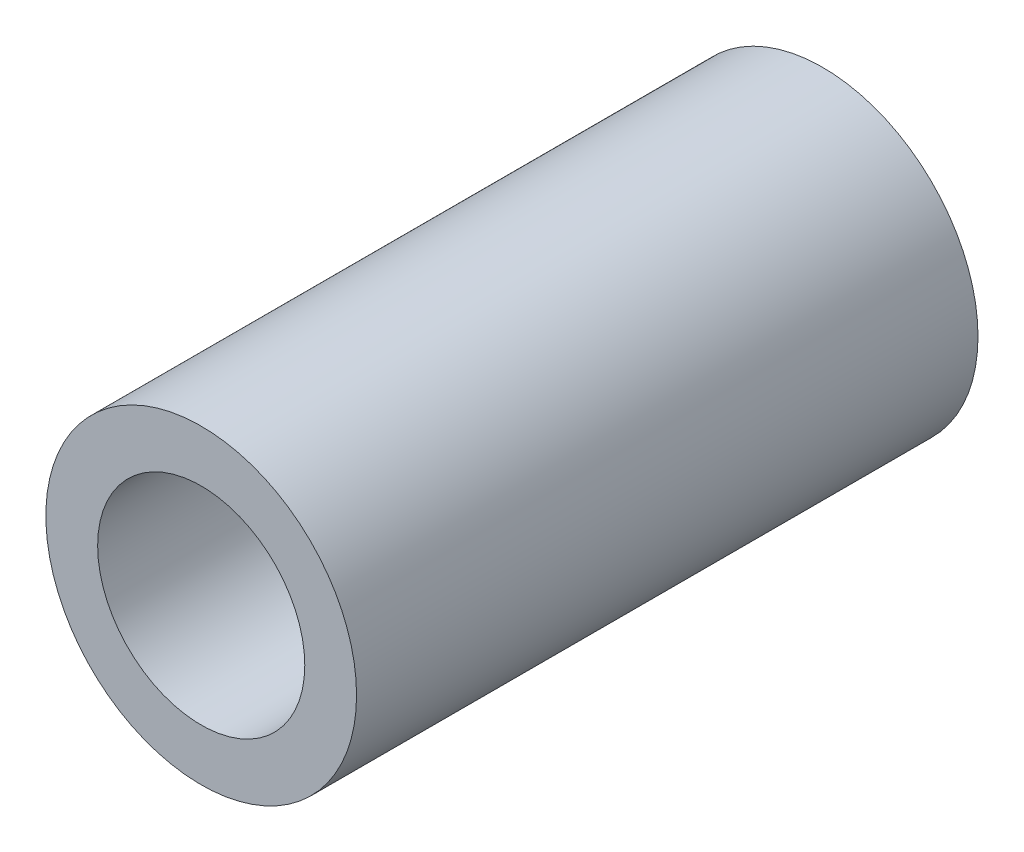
from build123d import *

# Parameters (mm, degrees)
SKETCH1_R      = 3
SKETCH1_R_2    = 2
EXTRUDE1_DEPTH = 12


with BuildPart() as part:
    # Sketch1 → Extrude1 (new body)
    with BuildSketch(Plane.XY):
        Circle(SKETCH1_R)
        Circle(SKETCH1_R_2, mode=Mode.SUBTRACT)
    extrude(amount=EXTRUDE1_DEPTH)


solid = part.part
